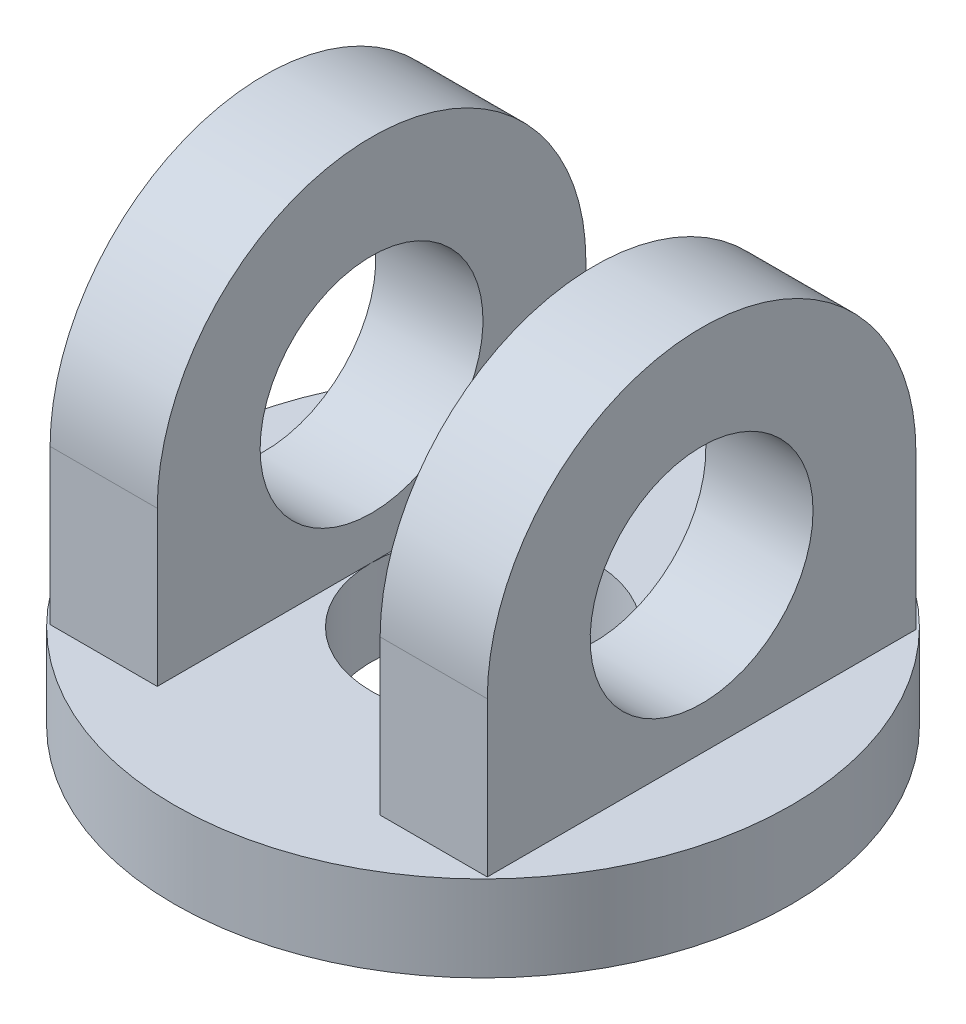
from build123d import *

# Parameters (mm, degrees)
SKETCH_1_R               = 72
EXTRUDE_1_DEPTH          = 20
EXTRUDE_2_DEPTH          = 51
EXTRUDE_2_DEPTH_BACK     = 51
CUT_EXTRUDE_1_DEPTH      = 147.982992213
CUT_EXTRUDE_1_DEPTH_BACK = 147.982992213
SKETCH_4_W               = 52
SKETCH_4_H               = 86
SKETCH_5_R               = 26
CUT_EXTRUDE_2_DEPTH      = 178.620381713
SKETCH_6_R               = 26
CUT_EXTRUDE_3_DEPTH      = 102


with BuildPart() as part:
    # Sketch 1 → Extrude 1 (new body)
    with BuildSketch(Plane(origin=(0, 0, 0), x_dir=(1, 0, 0), z_dir=(0, 1, 0))):
        with Locations(Location((0, 0, 0), (0, 0, 270))):
            Circle(SKETCH_1_R)
    extrude(amount=EXTRUDE_1_DEPTH)

    # Sketch 2 → Extrude 2 (add, two sides: drawn at the far end of the back side and taken through both)
    with BuildSketch(Plane(origin=(0, 0, 0), x_dir=(0, 0, -1), z_dir=(1, 0, 0)).offset(-EXTRUDE_2_DEPTH_BACK)):
        with BuildLine():
            Line((-50, 20), (50, 20))
            Line((50, 20), (50, 56))
            ThreePointArc((50, 56), (0, 106), (-50, 56))
            Line((-50, 56), (-50, 20))
        make_face()
    extrude(amount=EXTRUDE_2_DEPTH + EXTRUDE_2_DEPTH_BACK)

    # Sketch 4 → Cut-Extrude 1 (cut, two sides: drawn at the far end of the back side and taken through both)
    with BuildSketch(Plane.XY.offset(-CUT_EXTRUDE_1_DEPTH_BACK)):
        with Locations((0, 63)):
            Rectangle(SKETCH_4_W, SKETCH_4_H)
    extrude(amount=CUT_EXTRUDE_1_DEPTH + CUT_EXTRUDE_1_DEPTH_BACK, mode=Mode.SUBTRACT)

    # Sketch 5 → Cut-Extrude 2 (cut, through all)
    with BuildSketch(Plane.ZY.offset(51)):
        with Locations(Location((0, 56, 0), (0, 0, 90))):
            Circle(SKETCH_5_R)
    extrude(amount=-CUT_EXTRUDE_2_DEPTH, mode=Mode.SUBTRACT)

    # Sketch 6 → Cut-Extrude 3 (cut)
    with BuildSketch(Plane(origin=(0, 20, 0), x_dir=(1, 0, 0), z_dir=(0, 1, 0))):
        with Locations(Location((0, 0, 0), (0, 0, 270))):
            Circle(SKETCH_6_R)
    extrude(amount=-CUT_EXTRUDE_3_DEPTH, mode=Mode.SUBTRACT)


solid = part.part
